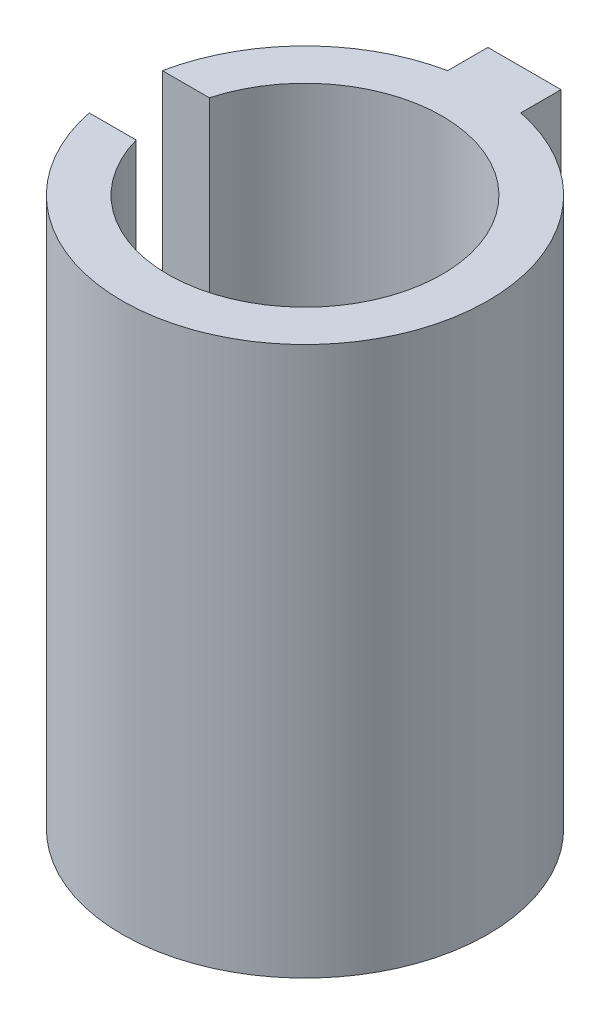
ISO-10303-21;
HEADER;
FILE_DESCRIPTION(('STEP AP214'),'2;1');
FILE_NAME('part.step','',(''),(''),'','','');
FILE_SCHEMA(('AUTOMOTIVE_DESIGN { 1 0 10303 214 1 1 1 1 }'));
ENDSEC;
DATA;
#1=APPLICATION_CONTEXT('core data for automotive mechanical design processes');
#2=APPLICATION_PROTOCOL_DEFINITION('international standard','automotive_design',2000,#1);
#3=PRODUCT_CONTEXT('',#1,'mechanical');
#4=PRODUCT('Part','Part','',(#3));
#5=PRODUCT_RELATED_PRODUCT_CATEGORY('part','',(#4));
#6=PRODUCT_DEFINITION_FORMATION('','',#4);
#7=PRODUCT_DEFINITION_CONTEXT('part definition',#1,'design');
#8=PRODUCT_DEFINITION('design','',#6,#7);
#9=PRODUCT_DEFINITION_SHAPE('','',#8);
#10=(LENGTH_UNIT() NAMED_UNIT(*) SI_UNIT(.MILLI.,.METRE.));
#11=(NAMED_UNIT(*) PLANE_ANGLE_UNIT() SI_UNIT($,.RADIAN.));
#12=(NAMED_UNIT(*) SI_UNIT($,.STERADIAN.) SOLID_ANGLE_UNIT());
#13=UNCERTAINTY_MEASURE_WITH_UNIT(LENGTH_MEASURE(1.E-05),#10,'distance_accuracy_value','');
#14=(GEOMETRIC_REPRESENTATION_CONTEXT(3) GLOBAL_UNCERTAINTY_ASSIGNED_CONTEXT((#13)) GLOBAL_UNIT_ASSIGNED_CONTEXT((#10,
#11,#12)) REPRESENTATION_CONTEXT('',''));
#15=CARTESIAN_POINT('',(0.,0.,0.));
#16=DIRECTION('',(0.,0.,1.));
#17=DIRECTION('',(1.,0.,0.));
#18=AXIS2_PLACEMENT_3D('',#15,#16,#17);
#19=CARTESIAN_POINT('',(0.,30.,0.));
#20=DIRECTION('',(0.,-1.,0.));
#21=DIRECTION('',(0.,0.,-1.));
#22=AXIS2_PLACEMENT_3D('',#19,#20,#21);
#23=CYLINDRICAL_SURFACE('',#22,7.5);
#24=CARTESIAN_POINT('',(0.,0.,0.));
#25=DIRECTION('',(0.,-1.,0.));
#26=DIRECTION('',(0.,0.,1.));
#27=AXIS2_PLACEMENT_3D('',#24,#25,#26);
#28=CIRCLE('',#27,7.5);
#29=CARTESIAN_POINT('',(-7.22841614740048,0.,-2.));
#30=VERTEX_POINT('',#29);
#31=CARTESIAN_POINT('',(-7.22841614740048,0.,2.));
#32=VERTEX_POINT('',#31);
#33=EDGE_CURVE('E101',#30,#32,#28,.T.);
#34=ORIENTED_EDGE('',*,*,#33,.T.);
#35=DIRECTION('',(0.,-1.,0.));
#36=VECTOR('',#35,1.);
#37=CARTESIAN_POINT('',(-7.22841614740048,30.,2.));
#38=LINE('',#37,#36);
#39=CARTESIAN_POINT('',(-7.22841614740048,30.,2.));
#40=VERTEX_POINT('',#39);
#41=EDGE_CURVE('E11',#40,#32,#38,.T.);
#42=ORIENTED_EDGE('',*,*,#41,.F.);
#43=CARTESIAN_POINT('',(0.,30.,0.));
#44=DIRECTION('',(0.,-1.,0.));
#45=DIRECTION('',(0.,0.,1.));
#46=AXIS2_PLACEMENT_3D('',#43,#44,#45);
#47=CIRCLE('',#46,7.5);
#48=CARTESIAN_POINT('',(-7.22841614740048,30.,-2.));
#49=VERTEX_POINT('',#48);
#50=EDGE_CURVE('E128',#49,#40,#47,.T.);
#51=ORIENTED_EDGE('',*,*,#50,.F.);
#52=DIRECTION('',(0.,-1.,0.));
#53=VECTOR('',#52,1.);
#54=CARTESIAN_POINT('',(-7.22841614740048,30.,-2.));
#55=LINE('',#54,#53);
#56=EDGE_CURVE('E114',#49,#30,#55,.T.);
#57=ORIENTED_EDGE('',*,*,#56,.T.);
#58=EDGE_LOOP('',(#34,#42,#51,#57));
#59=FACE_BOUND('',#58,.T.);
#60=ADVANCED_FACE('F33',(#59),#23,.F.);
#61=CARTESIAN_POINT('',(-7.22841614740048,30.,2.));
#62=DIRECTION('',(0.,0.,1.));
#63=DIRECTION('',(1.,0.,0.));
#64=AXIS2_PLACEMENT_3D('',#61,#62,#63);
#65=PLANE('',#64);
#66=DIRECTION('',(-1.,0.,0.));
#67=VECTOR('',#66,1.);
#68=CARTESIAN_POINT('',(-7.22841614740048,0.,2.));
#69=LINE('',#68,#67);
#70=CARTESIAN_POINT('',(-9.79795897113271,0.,2.));
#71=VERTEX_POINT('',#70);
#72=EDGE_CURVE('E97',#32,#71,#69,.T.);
#73=ORIENTED_EDGE('',*,*,#72,.T.);
#74=DIRECTION('',(0.,-1.,0.));
#75=VECTOR('',#74,1.);
#76=CARTESIAN_POINT('',(-9.79795897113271,30.,2.));
#77=LINE('',#76,#75);
#78=CARTESIAN_POINT('',(-9.79795897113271,30.,2.));
#79=VERTEX_POINT('',#78);
#80=EDGE_CURVE('E40',#79,#71,#77,.T.);
#81=ORIENTED_EDGE('',*,*,#80,.F.);
#82=DIRECTION('',(-1.,0.,0.));
#83=VECTOR('',#82,1.);
#84=CARTESIAN_POINT('',(-7.22841614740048,30.,2.));
#85=LINE('',#84,#83);
#86=EDGE_CURVE('E110',#40,#79,#85,.T.);
#87=ORIENTED_EDGE('',*,*,#86,.F.);
#88=ORIENTED_EDGE('',*,*,#41,.T.);
#89=EDGE_LOOP('',(#73,#81,#87,#88));
#90=FACE_BOUND('',#89,.T.);
#91=ADVANCED_FACE('F109',(#90),#65,.F.);
#92=CARTESIAN_POINT('',(0.,30.,0.));
#93=DIRECTION('',(0.,-1.,0.));
#94=DIRECTION('',(0.,0.,-1.));
#95=AXIS2_PLACEMENT_3D('',#92,#93,#94);
#96=CYLINDRICAL_SURFACE('',#95,10.);
#97=CARTESIAN_POINT('',(0.,0.,0.));
#98=DIRECTION('',(0.,1.,0.));
#99=DIRECTION('',(0.,0.,1.));
#100=AXIS2_PLACEMENT_3D('',#97,#98,#99);
#101=CIRCLE('',#100,10.);
#102=CARTESIAN_POINT('',(2.,0.,-9.79795897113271));
#103=VERTEX_POINT('',#102);
#104=EDGE_CURVE('E103',#71,#103,#101,.T.);
#105=ORIENTED_EDGE('',*,*,#104,.T.);
#106=DIRECTION('',(0.,-1.,0.));
#107=VECTOR('',#106,1.);
#108=CARTESIAN_POINT('',(2.,30.,-9.79795897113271));
#109=LINE('',#108,#107);
#110=CARTESIAN_POINT('',(2.,30.,-9.79795897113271));
#111=VERTEX_POINT('',#110);
#112=EDGE_CURVE('E154',#111,#103,#109,.T.);
#113=ORIENTED_EDGE('',*,*,#112,.F.);
#114=CARTESIAN_POINT('',(0.,30.,0.));
#115=DIRECTION('',(0.,1.,0.));
#116=DIRECTION('',(0.,0.,1.));
#117=AXIS2_PLACEMENT_3D('',#114,#115,#116);
#118=CIRCLE('',#117,10.);
#119=EDGE_CURVE('E131',#79,#111,#118,.T.);
#120=ORIENTED_EDGE('',*,*,#119,.F.);
#121=ORIENTED_EDGE('',*,*,#80,.T.);
#122=EDGE_LOOP('',(#105,#113,#120,#121));
#123=FACE_BOUND('',#122,.T.);
#124=ADVANCED_FACE('F158',(#123),#96,.T.);
#125=CARTESIAN_POINT('',(2.,30.,-9.79795897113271));
#126=DIRECTION('',(-1.,0.,0.));
#127=DIRECTION('',(0.,0.,1.));
#128=AXIS2_PLACEMENT_3D('',#125,#126,#127);
#129=PLANE('',#128);
#130=DIRECTION('',(0.,0.,-1.));
#131=VECTOR('',#130,1.);
#132=CARTESIAN_POINT('',(2.,0.,-9.79795897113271));
#133=LINE('',#132,#131);
#134=CARTESIAN_POINT('',(2.,0.,-12.));
#135=VERTEX_POINT('',#134);
#136=EDGE_CURVE('E118',#103,#135,#133,.T.);
#137=ORIENTED_EDGE('',*,*,#136,.T.);
#138=DIRECTION('',(0.,-1.,0.));
#139=VECTOR('',#138,1.);
#140=CARTESIAN_POINT('',(2.,30.,-12.));
#141=LINE('',#140,#139);
#142=CARTESIAN_POINT('',(2.,30.,-12.));
#143=VERTEX_POINT('',#142);
#144=EDGE_CURVE('E151',#143,#135,#141,.T.);
#145=ORIENTED_EDGE('',*,*,#144,.F.);
#146=DIRECTION('',(0.,0.,-1.));
#147=VECTOR('',#146,1.);
#148=CARTESIAN_POINT('',(2.,30.,-9.79795897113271));
#149=LINE('',#148,#147);
#150=EDGE_CURVE('E133',#111,#143,#149,.T.);
#151=ORIENTED_EDGE('',*,*,#150,.F.);
#152=ORIENTED_EDGE('',*,*,#112,.T.);
#153=EDGE_LOOP('',(#137,#145,#151,#152));
#154=FACE_BOUND('',#153,.T.);
#155=ADVANCED_FACE('F166',(#154),#129,.F.);
#156=CARTESIAN_POINT('',(2.,30.,-12.));
#157=DIRECTION('',(0.,0.,1.));
#158=DIRECTION('',(1.,0.,0.));
#159=AXIS2_PLACEMENT_3D('',#156,#157,#158);
#160=PLANE('',#159);
#161=DIRECTION('',(-1.,0.,0.));
#162=VECTOR('',#161,1.);
#163=CARTESIAN_POINT('',(2.,0.,-12.));
#164=LINE('',#163,#162);
#165=CARTESIAN_POINT('',(-2.,0.,-12.));
#166=VERTEX_POINT('',#165);
#167=EDGE_CURVE('E120',#135,#166,#164,.T.);
#168=ORIENTED_EDGE('',*,*,#167,.T.);
#169=DIRECTION('',(0.,-1.,0.));
#170=VECTOR('',#169,1.);
#171=CARTESIAN_POINT('',(-2.,30.,-12.));
#172=LINE('',#171,#170);
#173=CARTESIAN_POINT('',(-2.,30.,-12.));
#174=VERTEX_POINT('',#173);
#175=EDGE_CURVE('E148',#174,#166,#172,.T.);
#176=ORIENTED_EDGE('',*,*,#175,.F.);
#177=DIRECTION('',(-1.,0.,0.));
#178=VECTOR('',#177,1.);
#179=CARTESIAN_POINT('',(2.,30.,-12.));
#180=LINE('',#179,#178);
#181=EDGE_CURVE('E135',#143,#174,#180,.T.);
#182=ORIENTED_EDGE('',*,*,#181,.F.);
#183=ORIENTED_EDGE('',*,*,#144,.T.);
#184=EDGE_LOOP('',(#168,#176,#182,#183));
#185=FACE_BOUND('',#184,.T.);
#186=ADVANCED_FACE('F169',(#185),#160,.F.);
#187=CARTESIAN_POINT('',(-2.,30.,-9.79795897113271));
#188=DIRECTION('',(1.,0.,0.));
#189=DIRECTION('',(0.,0.,-1.));
#190=AXIS2_PLACEMENT_3D('',#187,#188,#189);
#191=PLANE('',#190);
#192=DIRECTION('',(0.,0.,1.));
#193=VECTOR('',#192,1.);
#194=CARTESIAN_POINT('',(-2.,0.,-9.79795897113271));
#195=LINE('',#194,#193);
#196=CARTESIAN_POINT('',(-2.,0.,-9.79795897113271));
#197=VERTEX_POINT('',#196);
#198=EDGE_CURVE('E122',#166,#197,#195,.T.);
#199=ORIENTED_EDGE('',*,*,#198,.T.);
#200=DIRECTION('',(0.,-1.,0.));
#201=VECTOR('',#200,1.);
#202=CARTESIAN_POINT('',(-2.,30.,-9.79795897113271));
#203=LINE('',#202,#201);
#204=CARTESIAN_POINT('',(-2.,30.,-9.79795897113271));
#205=VERTEX_POINT('',#204);
#206=EDGE_CURVE('E145',#205,#197,#203,.T.);
#207=ORIENTED_EDGE('',*,*,#206,.F.);
#208=DIRECTION('',(0.,0.,1.));
#209=VECTOR('',#208,1.);
#210=CARTESIAN_POINT('',(-2.,30.,-9.79795897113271));
#211=LINE('',#210,#209);
#212=EDGE_CURVE('E137',#174,#205,#211,.T.);
#213=ORIENTED_EDGE('',*,*,#212,.F.);
#214=ORIENTED_EDGE('',*,*,#175,.T.);
#215=EDGE_LOOP('',(#199,#207,#213,#214));
#216=FACE_BOUND('',#215,.T.);
#217=ADVANCED_FACE('F174',(#216),#191,.F.);
#218=CARTESIAN_POINT('',(0.,30.,0.));
#219=DIRECTION('',(0.,-1.,0.));
#220=DIRECTION('',(0.,0.,-1.));
#221=AXIS2_PLACEMENT_3D('',#218,#219,#220);
#222=CYLINDRICAL_SURFACE('',#221,10.);
#223=CARTESIAN_POINT('',(0.,0.,0.));
#224=DIRECTION('',(0.,1.,0.));
#225=DIRECTION('',(0.,0.,1.));
#226=AXIS2_PLACEMENT_3D('',#223,#224,#225);
#227=CIRCLE('',#226,10.);
#228=CARTESIAN_POINT('',(-9.79795897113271,0.,-2.));
#229=VERTEX_POINT('',#228);
#230=EDGE_CURVE('E124',#197,#229,#227,.T.);
#231=ORIENTED_EDGE('',*,*,#230,.T.);
#232=DIRECTION('',(0.,-1.,0.));
#233=VECTOR('',#232,1.);
#234=CARTESIAN_POINT('',(-9.79795897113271,30.,-2.));
#235=LINE('',#234,#233);
#236=CARTESIAN_POINT('',(-9.79795897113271,30.,-2.));
#237=VERTEX_POINT('',#236);
#238=EDGE_CURVE('E142',#237,#229,#235,.T.);
#239=ORIENTED_EDGE('',*,*,#238,.F.);
#240=CARTESIAN_POINT('',(0.,30.,0.));
#241=DIRECTION('',(0.,1.,0.));
#242=DIRECTION('',(0.,0.,1.));
#243=AXIS2_PLACEMENT_3D('',#240,#241,#242);
#244=CIRCLE('',#243,10.);
#245=EDGE_CURVE('E52',#205,#237,#244,.T.);
#246=ORIENTED_EDGE('',*,*,#245,.F.);
#247=ORIENTED_EDGE('',*,*,#206,.T.);
#248=EDGE_LOOP('',(#231,#239,#246,#247));
#249=FACE_BOUND('',#248,.T.);
#250=ADVANCED_FACE('F177',(#249),#222,.T.);
#251=CARTESIAN_POINT('',(-7.22841614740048,30.,-2.));
#252=DIRECTION('',(0.,0.,-1.));
#253=DIRECTION('',(-1.,0.,0.));
#254=AXIS2_PLACEMENT_3D('',#251,#252,#253);
#255=PLANE('',#254);
#256=DIRECTION('',(1.,0.,0.));
#257=VECTOR('',#256,1.);
#258=CARTESIAN_POINT('',(-7.22841614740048,0.,-2.));
#259=LINE('',#258,#257);
#260=EDGE_CURVE('E126',#229,#30,#259,.T.);
#261=ORIENTED_EDGE('',*,*,#260,.T.);
#262=ORIENTED_EDGE('',*,*,#56,.F.);
#263=DIRECTION('',(1.,0.,0.));
#264=VECTOR('',#263,1.);
#265=CARTESIAN_POINT('',(-7.22841614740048,30.,-2.));
#266=LINE('',#265,#264);
#267=EDGE_CURVE('E47',#237,#49,#266,.T.);
#268=ORIENTED_EDGE('',*,*,#267,.F.);
#269=ORIENTED_EDGE('',*,*,#238,.T.);
#270=EDGE_LOOP('',(#261,#262,#268,#269));
#271=FACE_BOUND('',#270,.T.);
#272=ADVANCED_FACE('F179',(#271),#255,.F.);
#273=CARTESIAN_POINT('',(0.,30.,0.));
#274=DIRECTION('',(0.,1.,0.));
#275=DIRECTION('',(0.,0.,1.));
#276=AXIS2_PLACEMENT_3D('',#273,#274,#275);
#277=PLANE('',#276);
#278=ORIENTED_EDGE('',*,*,#50,.T.);
#279=ORIENTED_EDGE('',*,*,#86,.T.);
#280=ORIENTED_EDGE('',*,*,#119,.T.);
#281=ORIENTED_EDGE('',*,*,#150,.T.);
#282=ORIENTED_EDGE('',*,*,#181,.T.);
#283=ORIENTED_EDGE('',*,*,#212,.T.);
#284=ORIENTED_EDGE('',*,*,#245,.T.);
#285=ORIENTED_EDGE('',*,*,#267,.T.);
#286=EDGE_LOOP('',(#278,#279,#280,#281,#282,#283,#284,#285));
#287=FACE_BOUND('',#286,.T.);
#288=ADVANCED_FACE('F161',(#287),#277,.T.);
#289=CARTESIAN_POINT('',(0.,0.,0.));
#290=DIRECTION('',(0.,1.,0.));
#291=DIRECTION('',(0.,0.,1.));
#292=AXIS2_PLACEMENT_3D('',#289,#290,#291);
#293=PLANE('',#292);
#294=ORIENTED_EDGE('',*,*,#33,.F.);
#295=ORIENTED_EDGE('',*,*,#260,.F.);
#296=ORIENTED_EDGE('',*,*,#230,.F.);
#297=ORIENTED_EDGE('',*,*,#198,.F.);
#298=ORIENTED_EDGE('',*,*,#167,.F.);
#299=ORIENTED_EDGE('',*,*,#136,.F.);
#300=ORIENTED_EDGE('',*,*,#104,.F.);
#301=ORIENTED_EDGE('',*,*,#72,.F.);
#302=EDGE_LOOP('',(#294,#295,#296,#297,#298,#299,#300,#301));
#303=FACE_BOUND('',#302,.T.);
#304=ADVANCED_FACE('F98',(#303),#293,.F.);
#305=CLOSED_SHELL('',(#60,#91,#124,#155,#186,#217,#250,#272,#288,#304));
#306=MANIFOLD_SOLID_BREP('B2',#305);
#307=ADVANCED_BREP_SHAPE_REPRESENTATION('',(#18,#306),#14);
#308=SHAPE_DEFINITION_REPRESENTATION(#9,#307);
ENDSEC;
END-ISO-10303-21;
